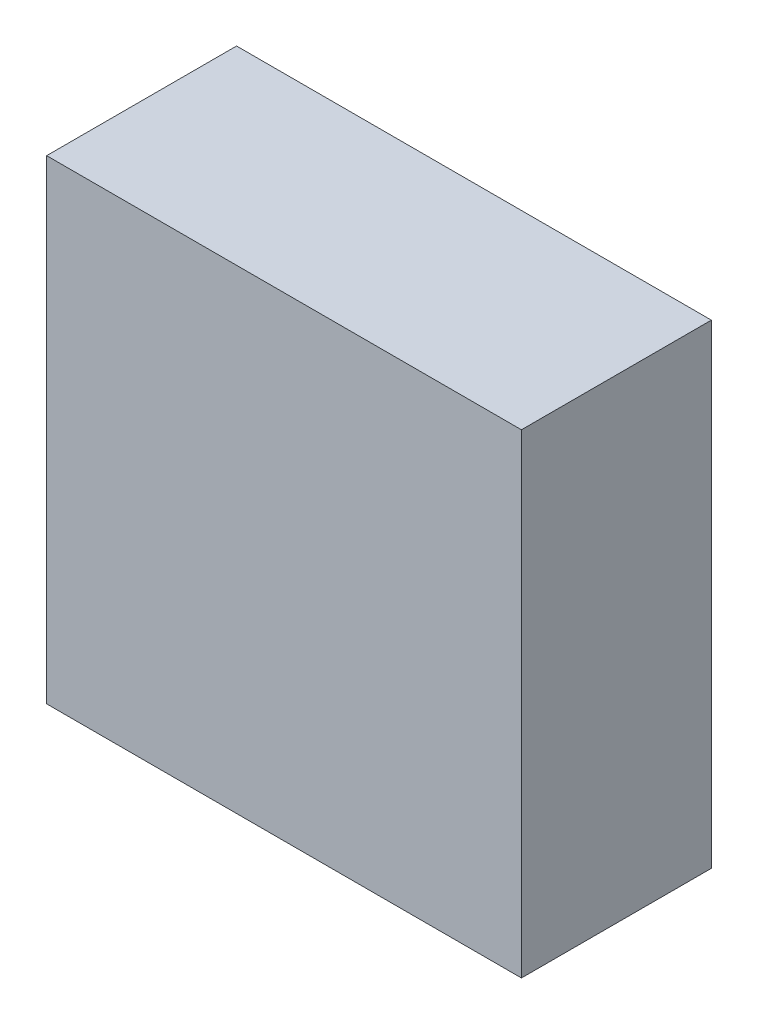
from build123d import *

# Parameters (mm, degrees)
SKIZZE1_W               = 25
SKIZZE1_H               = 25
LINEAR_AUSTRAGEN1_DEPTH = 10


with BuildPart() as part:
    # Skizze1 → Linear austragen1 (new body)
    with BuildSketch(Plane.XY):
        with Locations((12.5, 12.5)):
            Rectangle(SKIZZE1_W, SKIZZE1_H)
    extrude(amount=LINEAR_AUSTRAGEN1_DEPTH)


solid = part.part
